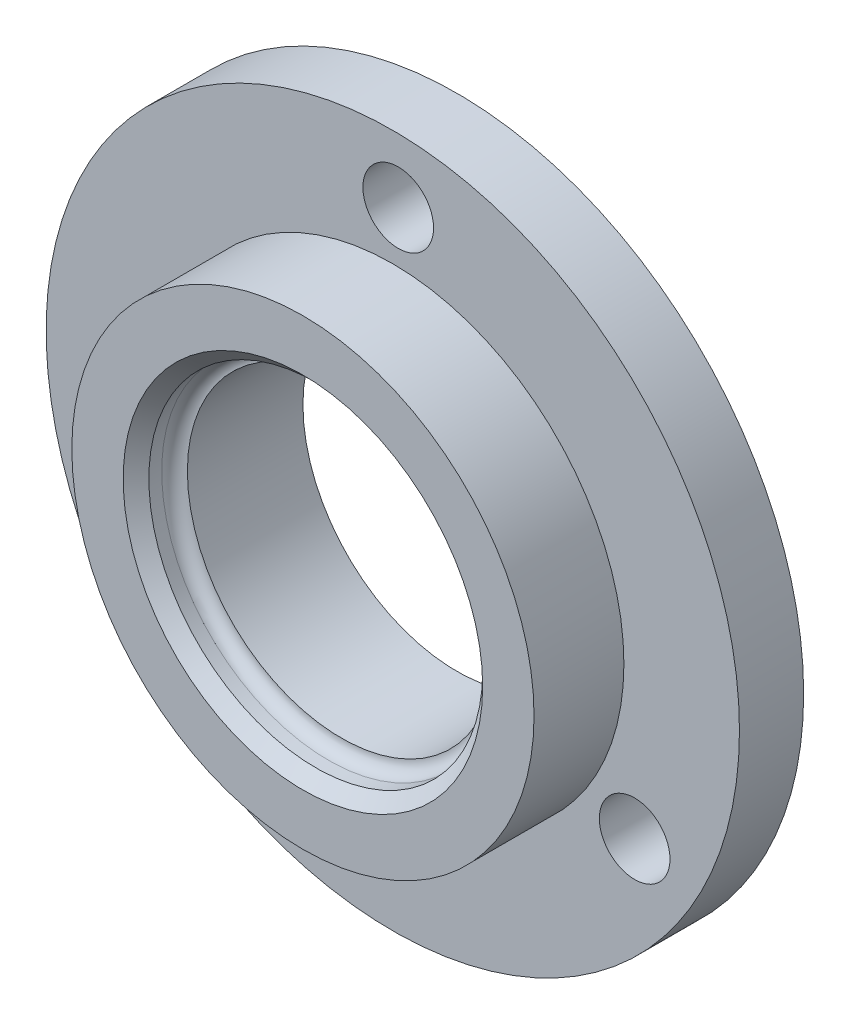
from build123d import *

# Parameters (mm, degrees)
ESQUISSE1_R                  = 27
EXTRUSION1_DEPTH             = 5
ESQUISSE2_R                  = 18
EXTRUSION2_DEPTH             = 7
ESQUISSE3_R                  = 13
ENL_V_MAT_EXTRU_2_DEPTH      = 3
CONG_1_R                     = 1
D_GAGEMENT_M51_D             = 5.5
R_P_TITION_CIRCULAIRE1_COUNT = 3
ESQUISSE5_R                  = 12
ENL_V_MAT_EXTRU_3_DEPTH      = 41.024992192
CHANFREIN1_SIZE              = 1


with BuildPart() as part:
    # Esquisse1 → Extrusion1 (new body)
    with BuildSketch(Plane.XY):
        Circle(ESQUISSE1_R)
    extrude(amount=EXTRUSION1_DEPTH)

    # Esquisse2 → Extrusion2 (add)
    with BuildSketch(Plane.XY.offset(5)):
        Circle(ESQUISSE2_R)
    extrude(amount=EXTRUSION2_DEPTH)

    # Esquisse3 → Enl_v. mat.-Extru.2 (cut)
    with BuildSketch(Plane.XY.offset(12)):
        Circle(ESQUISSE3_R)
    extrude(amount=-ENL_V_MAT_EXTRU_2_DEPTH, mode=Mode.SUBTRACT)

    # Cong_1
    cong_1_edges = [part.edges().sort_by_distance(p)[0] for p in [
        (-13, 0, 9),
    ]]
    fillet(cong_1_edges, radius=CONG_1_R)

    # D_gagement M51 (through all)
    with Locations(Plane(origin=(0.422998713, 21.995933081, 0), x_dir=(-1, 0, 0), z_dir=(0, 0, -1))):
        with Locations((0, 0)):
            d_gagement_m51 = Hole(D_GAGEMENT_M51_D / 2)

    # R_p_tition circulaire1: D_gagement M51 ×3 about axis
    r_p_tition_circulaire1_axis = Axis((0, 0, 0), (0, 0, 1))
    for i in range(1, R_P_TITION_CIRCULAIRE1_COUNT):
        add(d_gagement_m51.rotate(r_p_tition_circulaire1_axis, i * 360 / R_P_TITION_CIRCULAIRE1_COUNT), mode=Mode.SUBTRACT)

    # Esquisse5 → Enl_v. mat.-Extru.3 (cut, through all)
    with BuildSketch(Plane(origin=(0, 0, 0), x_dir=(-1, 0, 0), z_dir=(0, 0, -1))):
        Circle(ESQUISSE5_R)
    extrude(amount=-ENL_V_MAT_EXTRU_3_DEPTH, mode=Mode.SUBTRACT)

    # Chanfrein1
    chanfrein1_edges = [part.edges().sort_by_distance(p)[0] for p in [
        (-13, 0, 12),
    ]]
    chamfer(chanfrein1_edges, length=CHANFREIN1_SIZE)


solid = part.part
